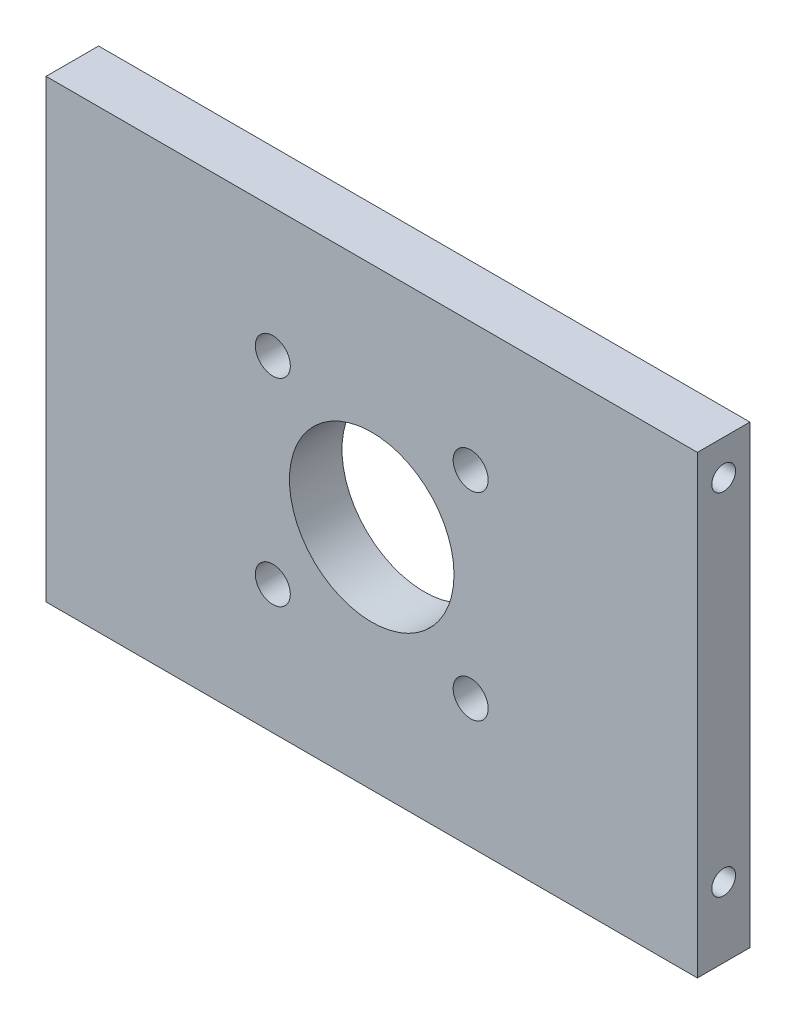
from build123d import *

# Parameters (mm, degrees)
ESQUISSE1_W                = 186
ESQUISSE1_H                = 130
BASE_EXTRUSION_DEPTH       = 15
ESQUISSE2_R                = 23.5
ENL_V_MAT_EXTRU_1_DEPTH    = 15
TROU_TARAUD_M8X1_251_D     = 6.8
TROU_TARAUD_M8X1_251_DEPTH = 46.25
TROU_TARAUD_M8X1_251_TIP   = 2.042926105
TROU_TARAUD_M8X1_252_D     = 6.8
TROU_TARAUD_M8X1_252_DEPTH = 46.25
TROU_TARAUD_M8X1_252_TIP   = 2.042926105
ESQUISSE9_R                = 5
ENL_V_MAT_EXTRU_2_DEPTH    = 20


with BuildPart() as part:
    # Esquisse1 → Base-Extrusion (new body)
    with BuildSketch(Plane.XY):
        with Locations((23.026869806, -1.306509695)):
            Rectangle(ESQUISSE1_W, ESQUISSE1_H)
    extrude(amount=BASE_EXTRUSION_DEPTH)

    # Esquisse2 → Enl_v. mat.-Extru.1 (cut)
    with BuildSketch(Plane.XY.offset(15)):
        with Locations((23.026869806, -1.306509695)):
            Circle(ESQUISSE2_R)
    extrude(amount=-ENL_V_MAT_EXTRU_1_DEPTH, mode=Mode.SUBTRACT)

    # Trou taraud_ M8x1.251
    with Locations(Plane.ZY.offset(69.973130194)):
        with Locations((7.5, 53.693490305), (7.5, -46.306509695)):
            Hole(TROU_TARAUD_M8X1_251_D / 2, depth=TROU_TARAUD_M8X1_251_DEPTH)
            with Locations((0, 0, -(TROU_TARAUD_M8X1_251_DEPTH + TROU_TARAUD_M8X1_251_TIP / 2))):  # 118° drill point
                Cone(0, TROU_TARAUD_M8X1_251_D / 2, TROU_TARAUD_M8X1_251_TIP, mode=Mode.SUBTRACT)

    # Trou taraud_ M8x1.252
    with Locations(Plane(origin=(116.026869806, 0, 0), x_dir=(0, 0, -1), z_dir=(1, 0, 0))):
        with Locations((-7.5, 53.693490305), (-7.5, -46.306509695)):
            Hole(TROU_TARAUD_M8X1_252_D / 2, depth=TROU_TARAUD_M8X1_252_DEPTH)
            with Locations((0, 0, -(TROU_TARAUD_M8X1_252_DEPTH + TROU_TARAUD_M8X1_252_TIP / 2))):  # 118° drill point
                Cone(0, TROU_TARAUD_M8X1_252_D / 2, TROU_TARAUD_M8X1_252_TIP, mode=Mode.SUBTRACT)

    # Esquisse9 → Enl_v. mat.-Extru.2 (cut)
    with BuildSketch(Plane(origin=(0, 0, 0), x_dir=(-1, 0, 0), z_dir=(0, 0, -1))):
        with Locations((5.223130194, 26.943490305)):
            Circle(ESQUISSE9_R)
        with Locations((5.223130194, -29.556509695)):
            Circle(ESQUISSE9_R)
        with Locations((-51.276869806, 26.943490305)):
            Circle(ESQUISSE9_R)
        with Locations((-51.276869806, -29.556509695)):
            Circle(ESQUISSE9_R)
    extrude(amount=-ENL_V_MAT_EXTRU_2_DEPTH, mode=Mode.SUBTRACT)


solid = part.part
